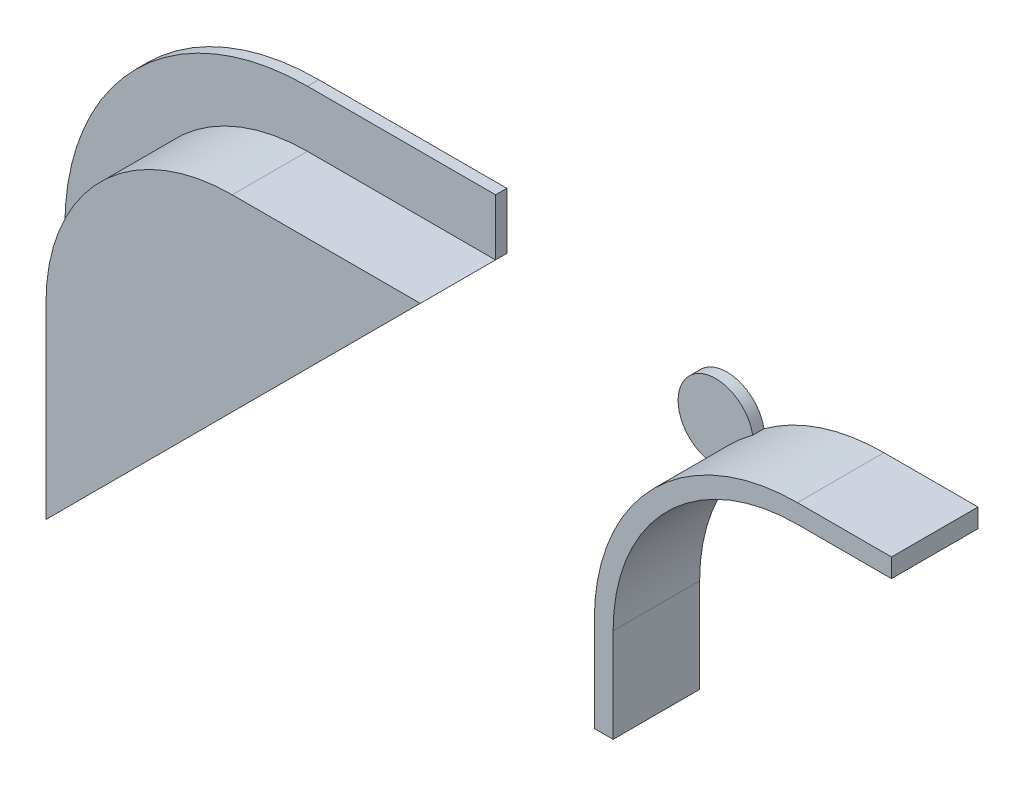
from build123d import *

# Parameters (mm, degrees)
AUFSATZ_LINEAR_AUSTRAGEN1_DEPTH = 4
AUFSATZ_LINEAR_AUSTRAGEN2_DEPTH = 0.6
AUFSATZ_LINEAR_AUSTRAGEN3_DEPTH = 4
AUFSATZ_LINEAR_AUSTRAGEN4_DEPTH = 0.6


with BuildPart() as part:
    # Skizze1 → Aufsatz-Linear austragen1 (new body)
    with BuildSketch(Plane.XY):
        with BuildLine():
            Line((-9.95, -9.95), (-9.95, 0.05))
            ThreePointArc((-9.95, 0.05), (-7.050357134, 7.050357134), (-0.05, 9.95))
            Line((-0.05, 9.95), (9.95, 9.95))
            Line((9.95, 9.95), (-9.95, -9.95))
        make_face()
    extrude(amount=AUFSATZ_LINEAR_AUSTRAGEN1_DEPTH)

    # Skizze2 → Aufsatz-Linear austragen2 (add)
    with BuildSketch(Plane(origin=(0, 0, 0), x_dir=(-1, 0, 0), z_dir=(0, 0, -1))):
        with BuildLine():
            Line((-9.95, 12.95), (-9.95, 9.95))
            Line((-9.95, 9.95), (9.95, -9.95))
            Line((9.95, -9.95), (12.95, -9.95))
            Line((12.95, -9.95), (12.95, 0.05))
            ThreePointArc((12.95, 0.05), (9.171677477, 9.171677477), (0.05, 12.95))
            Line((0.05, 12.95), (-9.95, 12.95))
        make_face()
    extrude(amount=AUFSATZ_LINEAR_AUSTRAGEN2_DEPTH)


with BuildPart() as body_2:
    # Skizze3 → Aufsatz-Linear austragen3 (new body)
    with BuildSketch(Plane.XY):
        with BuildLine():
            Line((19.2, 0), (19.2, -5))
            Line((19.2, -5), (20.2, -5))
            Line((20.2, -5), (20.2, 0))
            ThreePointArc((20.2, 0), (23.070353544, 6.929646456), (30, 9.8))
            Line((30, 9.8), (35, 9.8))
            Line((35, 9.8), (35, 10.8))
            Line((35, 10.8), (30, 10.8))
            ThreePointArc((30, 10.8), (22.363246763, 7.636753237), (19.2, 0))
        make_face()
    extrude(amount=AUFSATZ_LINEAR_AUSTRAGEN3_DEPTH)

    # Skizze4 → Aufsatz-Linear austragen4 (add)
    with BuildSketch(Plane(origin=(0, 0, 0), x_dir=(-1, 0, 0), z_dir=(0, 0, -1))):
        with BuildLine():
            Line((-20.2, 0), (-20.2, -5))
            Line((-20.2, -5), (-19.2, -5))
            Line((-19.2, -5), (-19.2, 0))
            ThreePointArc((-19.2, 0), (-19.734445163, 3.355351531), (-21.284885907, 6.37861947))
            ThreePointArc((-21.284885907, 6.37861947), (-20.24192642, 9.75807358), (-23.62138053, 8.715114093))
            ThreePointArc((-23.62138053, 8.715114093), (-26.644648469, 10.265554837), (-30, 10.8))
            Line((-30, 10.8), (-35, 10.8))
            Line((-35, 10.8), (-35, 9.8))
            Line((-35, 9.8), (-30, 9.8))
            ThreePointArc((-30, 9.8), (-23.070353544, 6.929646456), (-20.2, 0))
        make_face()
    extrude(amount=AUFSATZ_LINEAR_AUSTRAGEN4_DEPTH)


solid = Compound([part.part, body_2.part])
